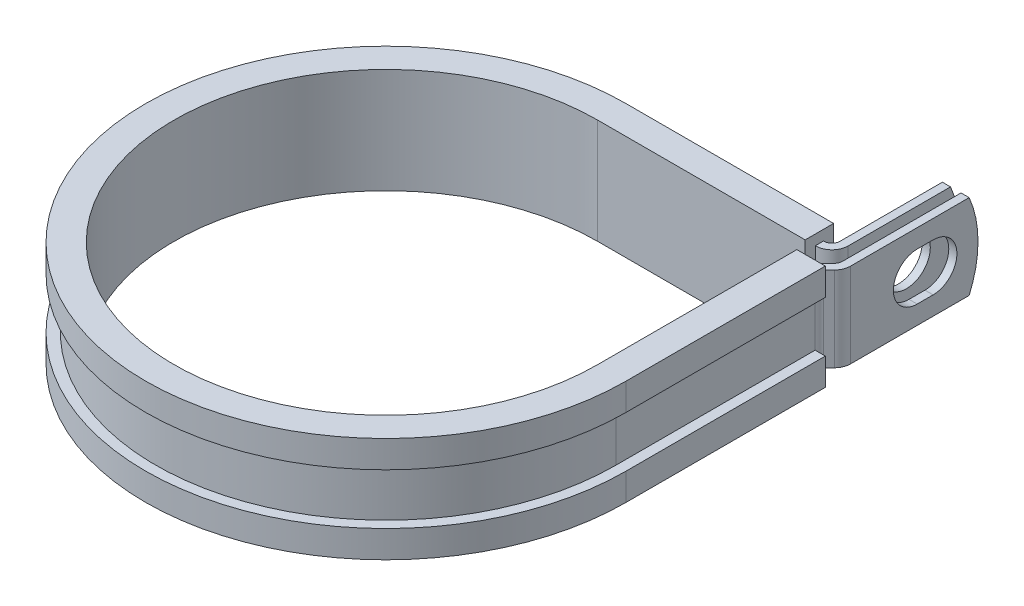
ISO-10303-21;
HEADER;
FILE_DESCRIPTION(('STEP AP214'),'2;1');
FILE_NAME('part.step','',(''),(''),'','','');
FILE_SCHEMA(('AUTOMOTIVE_DESIGN { 1 0 10303 214 1 1 1 1 }'));
ENDSEC;
DATA;
#1=APPLICATION_CONTEXT('core data for automotive mechanical design processes');
#2=APPLICATION_PROTOCOL_DEFINITION('international standard','automotive_design',2000,#1);
#3=PRODUCT_CONTEXT('',#1,'mechanical');
#4=PRODUCT('Part','Part','',(#3));
#5=PRODUCT_RELATED_PRODUCT_CATEGORY('part','',(#4));
#6=PRODUCT_DEFINITION_FORMATION('','',#4);
#7=PRODUCT_DEFINITION_CONTEXT('part definition',#1,'design');
#8=PRODUCT_DEFINITION('design','',#6,#7);
#9=PRODUCT_DEFINITION_SHAPE('','',#8);
#10=(LENGTH_UNIT() NAMED_UNIT(*) SI_UNIT(.MILLI.,.METRE.));
#11=(NAMED_UNIT(*) PLANE_ANGLE_UNIT() SI_UNIT($,.RADIAN.));
#12=(NAMED_UNIT(*) SI_UNIT($,.STERADIAN.) SOLID_ANGLE_UNIT());
#13=UNCERTAINTY_MEASURE_WITH_UNIT(LENGTH_MEASURE(1.E-05),#10,'distance_accuracy_value','');
#14=(GEOMETRIC_REPRESENTATION_CONTEXT(3) GLOBAL_UNCERTAINTY_ASSIGNED_CONTEXT((#13)) GLOBAL_UNIT_ASSIGNED_CONTEXT((#10,
#11,#12)) REPRESENTATION_CONTEXT('',''));
#15=CARTESIAN_POINT('',(0.,0.,0.));
#16=DIRECTION('',(0.,0.,1.));
#17=DIRECTION('',(1.,0.,0.));
#18=AXIS2_PLACEMENT_3D('',#15,#16,#17);
#19=CARTESIAN_POINT('',(33.9522698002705,-6.35,-33.274));
#20=DIRECTION('',(0.,1.,0.));
#21=DIRECTION('',(1.,0.,0.));
#22=AXIS2_PLACEMENT_3D('',#19,#20,#21);
#23=PLANE('',#22);
#24=DIRECTION('',(0.,0.,-1.));
#25=VECTOR('',#24,1.);
#26=CARTESIAN_POINT('',(31.1074698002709,-6.35,-33.274));
#27=LINE('',#26,#25);
#28=CARTESIAN_POINT('',(31.1074698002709,-6.35,-33.274));
#29=VERTEX_POINT('',#28);
#30=CARTESIAN_POINT('',(31.1074698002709,-6.35,-34.4932));
#31=VERTEX_POINT('',#30);
#32=EDGE_CURVE('E524',#29,#31,#27,.T.);
#33=ORIENTED_EDGE('',*,*,#32,.T.);
#34=DIRECTION('',(1.,0.,0.));
#35=VECTOR('',#34,1.);
#36=CARTESIAN_POINT('',(0.,-6.35,-34.4932));
#37=LINE('',#36,#35);
#38=CARTESIAN_POINT('',(31.1582698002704,-6.35,-34.4932));
#39=VERTEX_POINT('',#38);
#40=EDGE_CURVE('E411',#39,#31,#37,.F.);
#41=ORIENTED_EDGE('',*,*,#40,.F.);
#42=CARTESIAN_POINT('',(31.1582698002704,-6.35,-35.7124));
#43=DIRECTION('',(0.,1.,0.));
#44=DIRECTION('',(1.,0.,0.));
#45=AXIS2_PLACEMENT_3D('',#42,#43,#44);
#46=CIRCLE('',#45,1.2192);
#47=CARTESIAN_POINT('',(32.3774698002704,-6.35,-35.7124));
#48=VERTEX_POINT('',#47);
#49=EDGE_CURVE('E409',#48,#39,#46,.F.);
#50=ORIENTED_EDGE('',*,*,#49,.F.);
#51=DIRECTION('',(0.,0.,-1.));
#52=VECTOR('',#51,1.);
#53=CARTESIAN_POINT('',(32.3774698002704,-6.35,-52.3748));
#54=LINE('',#53,#52);
#55=CARTESIAN_POINT('',(32.3774698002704,-6.35,-51.0494778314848));
#56=VERTEX_POINT('',#55);
#57=EDGE_CURVE('E407',#56,#48,#54,.F.);
#58=ORIENTED_EDGE('',*,*,#57,.F.);
#59=DIRECTION('',(-1.,0.,0.));
#60=VECTOR('',#59,1.);
#61=CARTESIAN_POINT('',(36.3906698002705,-6.35,-51.0494778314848));
#62=LINE('',#61,#60);
#63=CARTESIAN_POINT('',(33.5966698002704,-6.35,-51.0494778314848));
#64=VERTEX_POINT('',#63);
#65=EDGE_CURVE('E12',#64,#56,#62,.T.);
#66=ORIENTED_EDGE('',*,*,#65,.F.);
#67=DIRECTION('',(0.,0.,1.));
#68=VECTOR('',#67,1.);
#69=CARTESIAN_POINT('',(33.5966698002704,-6.35,-52.3748));
#70=LINE('',#69,#68);
#71=CARTESIAN_POINT('',(33.5966698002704,-6.35,-35.7124));
#72=VERTEX_POINT('',#71);
#73=EDGE_CURVE('E405',#64,#72,#70,.T.);
#74=ORIENTED_EDGE('',*,*,#73,.T.);
#75=CARTESIAN_POINT('',(31.1582698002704,-6.35,-35.7124));
#76=DIRECTION('',(0.,-1.,0.));
#77=DIRECTION('',(0.,0.,1.));
#78=AXIS2_PLACEMENT_3D('',#75,#76,#77);
#79=CIRCLE('',#78,2.4384);
#80=CARTESIAN_POINT('',(31.1582698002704,-6.35,-33.274));
#81=VERTEX_POINT('',#80);
#82=EDGE_CURVE('E402',#72,#81,#79,.T.);
#83=ORIENTED_EDGE('',*,*,#82,.T.);
#84=DIRECTION('',(-1.,0.,0.));
#85=VECTOR('',#84,1.);
#86=CARTESIAN_POINT('',(0.,-6.35,-33.274));
#87=LINE('',#86,#85);
#88=EDGE_CURVE('E399',#81,#29,#87,.T.);
#89=ORIENTED_EDGE('',*,*,#88,.T.);
#90=EDGE_LOOP('',(#33,#41,#50,#58,#66,#74,#83,#89));
#91=FACE_BOUND('',#90,.T.);
#92=ADVANCED_FACE('F55',(#91),#23,.F.);
#93=CARTESIAN_POINT('',(33.9522698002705,6.35,-33.274));
#94=DIRECTION('',(0.,1.,0.));
#95=DIRECTION('',(1.,0.,0.));
#96=AXIS2_PLACEMENT_3D('',#93,#94,#95);
#97=PLANE('',#96);
#98=DIRECTION('',(1.,0.,0.));
#99=VECTOR('',#98,1.);
#100=CARTESIAN_POINT('',(0.,6.35,-34.4932));
#101=LINE('',#100,#99);
#102=CARTESIAN_POINT('',(31.1582698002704,6.35,-34.4932));
#103=VERTEX_POINT('',#102);
#104=CARTESIAN_POINT('',(31.1074698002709,6.35,-34.4932));
#105=VERTEX_POINT('',#104);
#106=EDGE_CURVE('E369',#103,#105,#101,.F.);
#107=ORIENTED_EDGE('',*,*,#106,.T.);
#108=DIRECTION('',(0.,0.,1.));
#109=VECTOR('',#108,1.);
#110=CARTESIAN_POINT('',(31.1074698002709,6.35,-34.4932));
#111=LINE('',#110,#109);
#112=CARTESIAN_POINT('',(31.1074698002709,6.35,-33.274));
#113=VERTEX_POINT('',#112);
#114=EDGE_CURVE('E518',#105,#113,#111,.T.);
#115=ORIENTED_EDGE('',*,*,#114,.T.);
#116=DIRECTION('',(-1.,0.,0.));
#117=VECTOR('',#116,1.);
#118=CARTESIAN_POINT('',(0.,6.35,-33.274));
#119=LINE('',#118,#117);
#120=CARTESIAN_POINT('',(31.1582698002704,6.35,-33.274));
#121=VERTEX_POINT('',#120);
#122=EDGE_CURVE('E626',#121,#113,#119,.T.);
#123=ORIENTED_EDGE('',*,*,#122,.F.);
#124=CARTESIAN_POINT('',(31.1582698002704,6.35,-35.7124));
#125=DIRECTION('',(0.,-1.,0.));
#126=DIRECTION('',(0.,0.,1.));
#127=AXIS2_PLACEMENT_3D('',#124,#125,#126);
#128=CIRCLE('',#127,2.4384);
#129=CARTESIAN_POINT('',(33.5966698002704,6.35,-35.7124));
#130=VERTEX_POINT('',#129);
#131=EDGE_CURVE('E371',#130,#121,#128,.T.);
#132=ORIENTED_EDGE('',*,*,#131,.F.);
#133=DIRECTION('',(0.,0.,1.));
#134=VECTOR('',#133,1.);
#135=CARTESIAN_POINT('',(33.5966698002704,6.35,-52.3748));
#136=LINE('',#135,#134);
#137=CARTESIAN_POINT('',(33.5966698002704,6.35,-51.0494778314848));
#138=VERTEX_POINT('',#137);
#139=EDGE_CURVE('E362',#138,#130,#136,.T.);
#140=ORIENTED_EDGE('',*,*,#139,.F.);
#141=DIRECTION('',(-1.,0.,0.));
#142=VECTOR('',#141,1.);
#143=CARTESIAN_POINT('',(36.3906698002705,6.35,-51.0494778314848));
#144=LINE('',#143,#142);
#145=CARTESIAN_POINT('',(32.3774698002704,6.35,-51.0494778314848));
#146=VERTEX_POINT('',#145);
#147=EDGE_CURVE('E63',#138,#146,#144,.T.);
#148=ORIENTED_EDGE('',*,*,#147,.T.);
#149=DIRECTION('',(0.,0.,-1.));
#150=VECTOR('',#149,1.);
#151=CARTESIAN_POINT('',(32.3774698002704,6.35,-52.3748));
#152=LINE('',#151,#150);
#153=CARTESIAN_POINT('',(32.3774698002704,6.35,-35.7124));
#154=VERTEX_POINT('',#153);
#155=EDGE_CURVE('E359',#146,#154,#152,.F.);
#156=ORIENTED_EDGE('',*,*,#155,.T.);
#157=CARTESIAN_POINT('',(31.1582698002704,6.35,-35.7124));
#158=DIRECTION('',(0.,1.,0.));
#159=DIRECTION('',(1.,0.,0.));
#160=AXIS2_PLACEMENT_3D('',#157,#158,#159);
#161=CIRCLE('',#160,1.2192);
#162=EDGE_CURVE('E367',#154,#103,#161,.F.);
#163=ORIENTED_EDGE('',*,*,#162,.T.);
#164=EDGE_LOOP('',(#107,#115,#123,#132,#140,#148,#156,#163));
#165=FACE_BOUND('',#164,.T.);
#166=ADVANCED_FACE('F358',(#165),#97,.T.);
#167=CARTESIAN_POINT('',(0.,6.35,-33.274));
#168=DIRECTION('',(0.,0.,1.));
#169=DIRECTION('',(1.,0.,0.));
#170=AXIS2_PLACEMENT_3D('',#167,#168,#169);
#171=PLANE('',#170);
#172=ORIENTED_EDGE('',*,*,#122,.T.);
#173=DIRECTION('',(0.,-1.,0.));
#174=VECTOR('',#173,1.);
#175=CARTESIAN_POINT('',(31.1074698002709,6.35,-33.274));
#176=LINE('',#175,#174);
#177=EDGE_CURVE('E521',#113,#29,#176,.T.);
#178=ORIENTED_EDGE('',*,*,#177,.T.);
#179=ORIENTED_EDGE('',*,*,#88,.F.);
#180=DIRECTION('',(0.,-1.,0.));
#181=VECTOR('',#180,1.);
#182=CARTESIAN_POINT('',(31.1582698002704,6.35,-33.274));
#183=LINE('',#182,#181);
#184=EDGE_CURVE('E345',#121,#81,#183,.T.);
#185=ORIENTED_EDGE('',*,*,#184,.F.);
#186=EDGE_LOOP('',(#172,#178,#179,#185));
#187=FACE_BOUND('',#186,.T.);
#188=ADVANCED_FACE('F636',(#187),#171,.T.);
#189=CARTESIAN_POINT('',(36.3906698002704,6.35,-33.274));
#190=DIRECTION('',(-1.,0.,0.));
#191=DIRECTION('',(0.,0.,1.));
#192=AXIS2_PLACEMENT_3D('',#189,#190,#191);
#193=PLANE('',#192);
#194=CARTESIAN_POINT('',(36.3906698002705,0.,-45.6437999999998));
#195=DIRECTION('',(1.,0.,0.));
#196=DIRECTION('',(0.,0.,-1.));
#197=AXIS2_PLACEMENT_3D('',#194,#195,#196);
#198=CIRCLE('',#197,3.5687);
#199=CARTESIAN_POINT('',(36.3906698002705,-3.5687,-45.6438000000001));
#200=VERTEX_POINT('',#199);
#201=CARTESIAN_POINT('',(36.3906698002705,3.5687,-45.6438000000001));
#202=VERTEX_POINT('',#201);
#203=EDGE_CURVE('E581',#200,#202,#198,.T.);
#204=ORIENTED_EDGE('',*,*,#203,.F.);
#205=DIRECTION('',(0.,0.,-1.));
#206=VECTOR('',#205,1.);
#207=CARTESIAN_POINT('',(36.3906698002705,-3.5687,-43.2561999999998));
#208=LINE('',#207,#206);
#209=CARTESIAN_POINT('',(36.3906698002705,-3.5687,-43.2561999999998));
#210=VERTEX_POINT('',#209);
#211=EDGE_CURVE('E584',#210,#200,#208,.T.);
#212=ORIENTED_EDGE('',*,*,#211,.F.);
#213=CARTESIAN_POINT('',(36.3906698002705,0.,-43.2561999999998));
#214=DIRECTION('',(1.,0.,0.));
#215=DIRECTION('',(0.,0.,-1.));
#216=AXIS2_PLACEMENT_3D('',#213,#214,#215);
#217=CIRCLE('',#216,3.5687);
#218=CARTESIAN_POINT('',(36.3906698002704,3.5687,-43.2561999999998));
#219=VERTEX_POINT('',#218);
#220=EDGE_CURVE('E577',#219,#210,#217,.T.);
#221=ORIENTED_EDGE('',*,*,#220,.F.);
#222=DIRECTION('',(0.,0.,1.));
#223=VECTOR('',#222,1.);
#224=CARTESIAN_POINT('',(36.3906698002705,3.5687,-43.2561999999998));
#225=LINE('',#224,#223);
#226=EDGE_CURVE('E578',#202,#219,#225,.T.);
#227=ORIENTED_EDGE('',*,*,#226,.F.);
#228=EDGE_LOOP('',(#204,#212,#221,#227));
#229=FACE_BOUND('',#228,.T.);
#230=DIRECTION('',(0.,0.,-1.));
#231=VECTOR('',#230,1.);
#232=CARTESIAN_POINT('',(36.3906698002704,-6.35,-33.274));
#233=LINE('',#232,#231);
#234=CARTESIAN_POINT('',(36.3906698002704,-6.35,-33.274));
#235=VERTEX_POINT('',#234);
#236=CARTESIAN_POINT('',(36.3906698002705,-6.35,-51.0494778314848));
#237=VERTEX_POINT('',#236);
#238=EDGE_CURVE('E383',#235,#237,#233,.T.);
#239=ORIENTED_EDGE('',*,*,#238,.T.);
#240=CARTESIAN_POINT('',(36.3906698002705,0.,-36.4998));
#241=DIRECTION('',(-1.,0.,0.));
#242=DIRECTION('',(0.,0.,1.));
#243=AXIS2_PLACEMENT_3D('',#240,#241,#242);
#244=CIRCLE('',#243,15.875);
#245=CARTESIAN_POINT('',(36.3906698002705,6.35,-51.0494778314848));
#246=VERTEX_POINT('',#245);
#247=EDGE_CURVE('E569',#246,#237,#244,.T.);
#248=ORIENTED_EDGE('',*,*,#247,.F.);
#249=DIRECTION('',(0.,0.,-1.));
#250=VECTOR('',#249,1.);
#251=CARTESIAN_POINT('',(36.3906698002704,6.35,-33.274));
#252=LINE('',#251,#250);
#253=CARTESIAN_POINT('',(36.3906698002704,6.35,-33.274));
#254=VERTEX_POINT('',#253);
#255=EDGE_CURVE('E420',#254,#246,#252,.T.);
#256=ORIENTED_EDGE('',*,*,#255,.F.);
#257=DIRECTION('',(0.,-1.,0.));
#258=VECTOR('',#257,1.);
#259=CARTESIAN_POINT('',(36.3906698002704,6.35,-33.274));
#260=LINE('',#259,#258);
#261=EDGE_CURVE('E382',#254,#235,#260,.T.);
#262=ORIENTED_EDGE('',*,*,#261,.T.);
#263=EDGE_LOOP('',(#239,#248,#256,#262));
#264=FACE_BOUND('',#263,.T.);
#265=ADVANCED_FACE('F57',(#229,#264),#193,.F.);
#266=CARTESIAN_POINT('',(35.1714698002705,6.35,-33.274));
#267=DIRECTION('',(-1.,0.,0.));
#268=DIRECTION('',(0.,0.,1.));
#269=AXIS2_PLACEMENT_3D('',#266,#267,#268);
#270=PLANE('',#269);
#271=DIRECTION('',(0.,0.,-1.));
#272=VECTOR('',#271,1.);
#273=CARTESIAN_POINT('',(35.1714698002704,-3.5687,-43.2561999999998));
#274=LINE('',#273,#272);
#275=CARTESIAN_POINT('',(35.1714698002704,-3.5687,-43.2561999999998));
#276=VERTEX_POINT('',#275);
#277=CARTESIAN_POINT('',(35.1714698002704,-3.5687,-45.6438000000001));
#278=VERTEX_POINT('',#277);
#279=EDGE_CURVE('E580',#276,#278,#274,.T.);
#280=ORIENTED_EDGE('',*,*,#279,.T.);
#281=CARTESIAN_POINT('',(35.1714698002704,0.,-45.6437999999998));
#282=DIRECTION('',(-1.,0.,0.));
#283=DIRECTION('',(0.,0.,1.));
#284=AXIS2_PLACEMENT_3D('',#281,#282,#283);
#285=CIRCLE('',#284,3.5687);
#286=CARTESIAN_POINT('',(35.1714698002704,3.5687,-45.6438000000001));
#287=VERTEX_POINT('',#286);
#288=EDGE_CURVE('E601',#278,#287,#285,.F.);
#289=ORIENTED_EDGE('',*,*,#288,.T.);
#290=DIRECTION('',(0.,0.,1.));
#291=VECTOR('',#290,1.);
#292=CARTESIAN_POINT('',(35.1714698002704,3.5687,-43.2561999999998));
#293=LINE('',#292,#291);
#294=CARTESIAN_POINT('',(35.1714698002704,3.5687,-43.2561999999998));
#295=VERTEX_POINT('',#294);
#296=EDGE_CURVE('E597',#287,#295,#293,.T.);
#297=ORIENTED_EDGE('',*,*,#296,.T.);
#298=CARTESIAN_POINT('',(35.1714698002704,0.,-43.2561999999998));
#299=DIRECTION('',(-1.,0.,0.));
#300=DIRECTION('',(0.,0.,1.));
#301=AXIS2_PLACEMENT_3D('',#298,#299,#300);
#302=CIRCLE('',#301,3.5687);
#303=EDGE_CURVE('E592',#295,#276,#302,.F.);
#304=ORIENTED_EDGE('',*,*,#303,.T.);
#305=EDGE_LOOP('',(#280,#289,#297,#304));
#306=FACE_BOUND('',#305,.T.);
#307=CARTESIAN_POINT('',(35.1714698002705,0.,-36.4998));
#308=DIRECTION('',(-1.,0.,0.));
#309=DIRECTION('',(0.,0.,1.));
#310=AXIS2_PLACEMENT_3D('',#307,#308,#309);
#311=CIRCLE('',#310,15.875);
#312=CARTESIAN_POINT('',(35.1714698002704,6.35,-51.0494778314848));
#313=VERTEX_POINT('',#312);
#314=CARTESIAN_POINT('',(35.1714698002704,-6.35,-51.0494778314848));
#315=VERTEX_POINT('',#314);
#316=EDGE_CURVE('E77',#313,#315,#311,.T.);
#317=ORIENTED_EDGE('',*,*,#316,.T.);
#318=DIRECTION('',(0.,0.,-1.));
#319=VECTOR('',#318,1.);
#320=CARTESIAN_POINT('',(35.1714698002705,-6.35,-33.274));
#321=LINE('',#320,#319);
#322=CARTESIAN_POINT('',(35.1714698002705,-6.35,-33.274));
#323=VERTEX_POINT('',#322);
#324=EDGE_CURVE('E386',#323,#315,#321,.T.);
#325=ORIENTED_EDGE('',*,*,#324,.F.);
#326=DIRECTION('',(0.,-1.,0.));
#327=VECTOR('',#326,1.);
#328=CARTESIAN_POINT('',(35.1714698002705,6.35,-33.274));
#329=LINE('',#328,#327);
#330=CARTESIAN_POINT('',(35.1714698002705,6.35,-33.274));
#331=VERTEX_POINT('',#330);
#332=EDGE_CURVE('E353',#331,#323,#329,.T.);
#333=ORIENTED_EDGE('',*,*,#332,.F.);
#334=DIRECTION('',(0.,0.,-1.));
#335=VECTOR('',#334,1.);
#336=CARTESIAN_POINT('',(35.1714698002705,6.35,-33.274));
#337=LINE('',#336,#335);
#338=EDGE_CURVE('E616',#331,#313,#337,.T.);
#339=ORIENTED_EDGE('',*,*,#338,.T.);
#340=EDGE_LOOP('',(#317,#325,#333,#339));
#341=FACE_BOUND('',#340,.T.);
#342=ADVANCED_FACE('F690',(#306,#341),#270,.T.);
#343=CARTESIAN_POINT('',(33.5966698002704,6.35,-52.3748));
#344=DIRECTION('',(1.,0.,0.));
#345=DIRECTION('',(0.,0.,-1.));
#346=AXIS2_PLACEMENT_3D('',#343,#344,#345);
#347=PLANE('',#346);
#348=CARTESIAN_POINT('',(33.5966698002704,0.,-44.45));
#349=DIRECTION('',(1.,0.,0.));
#350=DIRECTION('',(0.,0.,-1.));
#351=AXIS2_PLACEMENT_3D('',#348,#349,#350);
#352=CIRCLE('',#351,3.5687);
#353=CARTESIAN_POINT('',(33.5966698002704,0.,-48.0187));
#354=VERTEX_POINT('',#353);
#355=EDGE_CURVE('E387',#354,#354,#352,.F.);
#356=ORIENTED_EDGE('',*,*,#355,.T.);
#357=EDGE_LOOP('',(#356));
#358=FACE_BOUND('',#357,.T.);
#359=ORIENTED_EDGE('',*,*,#73,.F.);
#360=CARTESIAN_POINT('',(33.5966698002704,0.,-36.4998));
#361=DIRECTION('',(1.,0.,0.));
#362=DIRECTION('',(0.,0.,-1.));
#363=AXIS2_PLACEMENT_3D('',#360,#361,#362);
#364=CIRCLE('',#363,15.875);
#365=EDGE_CURVE('E574',#64,#138,#364,.T.);
#366=ORIENTED_EDGE('',*,*,#365,.T.);
#367=ORIENTED_EDGE('',*,*,#139,.T.);
#368=DIRECTION('',(0.,-1.,0.));
#369=VECTOR('',#368,1.);
#370=CARTESIAN_POINT('',(33.5966698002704,6.35,-35.7124));
#371=LINE('',#370,#369);
#372=EDGE_CURVE('E342',#130,#72,#371,.T.);
#373=ORIENTED_EDGE('',*,*,#372,.T.);
#374=EDGE_LOOP('',(#359,#366,#367,#373));
#375=FACE_BOUND('',#374,.T.);
#376=ADVANCED_FACE('F642',(#358,#375),#347,.T.);
#377=CARTESIAN_POINT('',(32.3774698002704,6.35,-52.3748));
#378=DIRECTION('',(1.,0.,0.));
#379=DIRECTION('',(0.,0.,-1.));
#380=AXIS2_PLACEMENT_3D('',#377,#378,#379);
#381=PLANE('',#380);
#382=CARTESIAN_POINT('',(32.3774698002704,0.,-44.45));
#383=DIRECTION('',(-1.,0.,0.));
#384=DIRECTION('',(0.,0.,1.));
#385=AXIS2_PLACEMENT_3D('',#382,#383,#384);
#386=CIRCLE('',#385,3.5687);
#387=CARTESIAN_POINT('',(32.3774698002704,0.,-40.8813));
#388=VERTEX_POINT('',#387);
#389=EDGE_CURVE('E609',#388,#388,#386,.T.);
#390=ORIENTED_EDGE('',*,*,#389,.F.);
#391=EDGE_LOOP('',(#390));
#392=FACE_BOUND('',#391,.T.);
#393=CARTESIAN_POINT('',(32.3774698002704,0.,-36.4998));
#394=DIRECTION('',(-1.,0.,0.));
#395=DIRECTION('',(0.,0.,1.));
#396=AXIS2_PLACEMENT_3D('',#393,#394,#395);
#397=CIRCLE('',#396,15.875);
#398=EDGE_CURVE('E69',#146,#56,#397,.T.);
#399=ORIENTED_EDGE('',*,*,#398,.T.);
#400=ORIENTED_EDGE('',*,*,#57,.T.);
#401=DIRECTION('',(0.,-1.,0.));
#402=VECTOR('',#401,1.);
#403=CARTESIAN_POINT('',(32.3774698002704,6.35,-35.7124));
#404=LINE('',#403,#402);
#405=EDGE_CURVE('E339',#154,#48,#404,.T.);
#406=ORIENTED_EDGE('',*,*,#405,.F.);
#407=ORIENTED_EDGE('',*,*,#155,.F.);
#408=EDGE_LOOP('',(#399,#400,#406,#407));
#409=FACE_BOUND('',#408,.T.);
#410=ADVANCED_FACE('F365',(#392,#409),#381,.F.);
#411=CARTESIAN_POINT('',(35.7124,-6.35,-29.8615026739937));
#412=DIRECTION('',(0.,1.,0.));
#413=DIRECTION('',(1.,0.,0.));
#414=AXIS2_PLACEMENT_3D('',#411,#412,#413);
#415=CIRCLE('',#414,1.21919999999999);
#416=CARTESIAN_POINT('',(34.4932,-6.35,-29.8615026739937));
#417=VERTEX_POINT('',#416);
#418=CARTESIAN_POINT('',(34.8502954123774,-6.35,-30.7236072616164));
#419=VERTEX_POINT('',#418);
#420=EDGE_CURVE('E414',#417,#419,#415,.F.);
#421=ORIENTED_EDGE('',*,*,#420,.F.);
#422=DIRECTION('',(1.,0.,0.));
#423=VECTOR('',#422,1.);
#424=CARTESIAN_POINT('',(33.274,-6.35,-29.8615026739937));
#425=LINE('',#424,#423);
#426=CARTESIAN_POINT('',(33.274,-6.35,-29.8615026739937));
#427=VERTEX_POINT('',#426);
#428=EDGE_CURVE('E452',#427,#417,#425,.T.);
#429=ORIENTED_EDGE('',*,*,#428,.F.);
#430=CARTESIAN_POINT('',(35.7124,-6.35,-29.8615026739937));
#431=DIRECTION('',(0.,-1.,0.));
#432=DIRECTION('',(0.,0.,1.));
#433=AXIS2_PLACEMENT_3D('',#430,#431,#432);
#434=CIRCLE('',#433,2.43839999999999);
#435=CARTESIAN_POINT('',(33.9881908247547,-6.35,-31.585711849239));
#436=VERTEX_POINT('',#435);
#437=EDGE_CURVE('E396',#427,#436,#434,.T.);
#438=ORIENTED_EDGE('',*,*,#437,.T.);
#439=DIRECTION('',(0.707106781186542,0.,-0.707106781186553));
#440=VECTOR('',#439,1.);
#441=CARTESIAN_POINT('',(33.9881908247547,-6.35,-31.585711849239));
#442=LINE('',#441,#440);
#443=CARTESIAN_POINT('',(34.8143743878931,-6.35,-32.4118954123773));
#444=VERTEX_POINT('',#443);
#445=EDGE_CURVE('E393',#436,#444,#442,.T.);
#446=ORIENTED_EDGE('',*,*,#445,.T.);
#447=CARTESIAN_POINT('',(33.9522698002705,-6.35,-33.274));
#448=DIRECTION('',(0.,1.,0.));
#449=DIRECTION('',(0.,0.,1.));
#450=AXIS2_PLACEMENT_3D('',#447,#448,#449);
#451=CIRCLE('',#450,1.2192);
#452=EDGE_CURVE('E390',#444,#323,#451,.T.);
#453=ORIENTED_EDGE('',*,*,#452,.T.);
#454=ORIENTED_EDGE('',*,*,#324,.T.);
#455=DIRECTION('',(-1.,0.,0.));
#456=VECTOR('',#455,1.);
#457=CARTESIAN_POINT('',(36.3906698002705,-6.35,-51.0494778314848));
#458=LINE('',#457,#456);
#459=EDGE_CURVE('E567',#237,#315,#458,.T.);
#460=ORIENTED_EDGE('',*,*,#459,.F.);
#461=ORIENTED_EDGE('',*,*,#238,.F.);
#462=CARTESIAN_POINT('',(33.9522698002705,-6.35,-33.274));
#463=DIRECTION('',(0.,1.,0.));
#464=DIRECTION('',(1.,0.,0.));
#465=AXIS2_PLACEMENT_3D('',#462,#463,#464);
#466=CIRCLE('',#465,2.4384);
#467=CARTESIAN_POINT('',(35.6764789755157,-6.35,-31.5497908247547));
#468=VERTEX_POINT('',#467);
#469=EDGE_CURVE('E418',#468,#235,#466,.T.);
#470=ORIENTED_EDGE('',*,*,#469,.F.);
#471=DIRECTION('',(0.707106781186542,0.,-0.707106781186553));
#472=VECTOR('',#471,1.);
#473=CARTESIAN_POINT('',(34.8502954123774,-6.35,-30.7236072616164));
#474=LINE('',#473,#472);
#475=EDGE_CURVE('E416',#419,#468,#474,.T.);
#476=ORIENTED_EDGE('',*,*,#475,.F.);
#477=EDGE_LOOP('',(#421,#429,#438,#446,#453,#454,#460,#461,#470,#476));
#478=FACE_BOUND('',#477,.T.);
#479=ADVANCED_FACE('F676',(#478),#23,.F.);
#480=DIRECTION('',(-1.,0.,0.));
#481=VECTOR('',#480,1.);
#482=CARTESIAN_POINT('',(34.4932,6.35,-29.8615026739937));
#483=LINE('',#482,#481);
#484=CARTESIAN_POINT('',(34.4932,6.35,-29.8615026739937));
#485=VERTEX_POINT('',#484);
#486=CARTESIAN_POINT('',(33.274,6.35,-29.8615026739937));
#487=VERTEX_POINT('',#486);
#488=EDGE_CURVE('E441',#485,#487,#483,.T.);
#489=ORIENTED_EDGE('',*,*,#488,.F.);
#490=CARTESIAN_POINT('',(35.7124,6.35,-29.8615026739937));
#491=DIRECTION('',(0.,1.,0.));
#492=DIRECTION('',(1.,0.,0.));
#493=AXIS2_PLACEMENT_3D('',#490,#491,#492);
#494=CIRCLE('',#493,1.21919999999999);
#495=CARTESIAN_POINT('',(34.8502954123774,6.35,-30.7236072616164));
#496=VERTEX_POINT('',#495);
#497=EDGE_CURVE('E376',#485,#496,#494,.F.);
#498=ORIENTED_EDGE('',*,*,#497,.T.);
#499=DIRECTION('',(0.707106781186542,0.,-0.707106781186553));
#500=VECTOR('',#499,1.);
#501=CARTESIAN_POINT('',(34.8502954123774,6.35,-30.7236072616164));
#502=LINE('',#501,#500);
#503=CARTESIAN_POINT('',(35.6764789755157,6.35,-31.5497908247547));
#504=VERTEX_POINT('',#503);
#505=EDGE_CURVE('E378',#496,#504,#502,.T.);
#506=ORIENTED_EDGE('',*,*,#505,.T.);
#507=CARTESIAN_POINT('',(33.9522698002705,6.35,-33.274));
#508=DIRECTION('',(0.,1.,0.));
#509=DIRECTION('',(1.,0.,0.));
#510=AXIS2_PLACEMENT_3D('',#507,#508,#509);
#511=CIRCLE('',#510,2.4384);
#512=EDGE_CURVE('E380',#504,#254,#511,.T.);
#513=ORIENTED_EDGE('',*,*,#512,.T.);
#514=ORIENTED_EDGE('',*,*,#255,.T.);
#515=DIRECTION('',(-1.,0.,0.));
#516=VECTOR('',#515,1.);
#517=CARTESIAN_POINT('',(36.3906698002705,6.35,-51.0494778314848));
#518=LINE('',#517,#516);
#519=EDGE_CURVE('E571',#246,#313,#518,.T.);
#520=ORIENTED_EDGE('',*,*,#519,.T.);
#521=ORIENTED_EDGE('',*,*,#338,.F.);
#522=CARTESIAN_POINT('',(33.9522698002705,6.35,-33.274));
#523=DIRECTION('',(0.,1.,0.));
#524=DIRECTION('',(0.,0.,1.));
#525=AXIS2_PLACEMENT_3D('',#522,#523,#524);
#526=CIRCLE('',#525,1.2192);
#527=CARTESIAN_POINT('',(34.8143743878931,6.35,-32.4118954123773));
#528=VERTEX_POINT('',#527);
#529=EDGE_CURVE('E619',#528,#331,#526,.T.);
#530=ORIENTED_EDGE('',*,*,#529,.F.);
#531=DIRECTION('',(0.707106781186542,0.,-0.707106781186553));
#532=VECTOR('',#531,1.);
#533=CARTESIAN_POINT('',(33.9881908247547,6.35,-31.585711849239));
#534=LINE('',#533,#532);
#535=CARTESIAN_POINT('',(33.9881908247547,6.35,-31.585711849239));
#536=VERTEX_POINT('',#535);
#537=EDGE_CURVE('E622',#536,#528,#534,.T.);
#538=ORIENTED_EDGE('',*,*,#537,.F.);
#539=CARTESIAN_POINT('',(35.7124,6.35,-29.8615026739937));
#540=DIRECTION('',(0.,-1.,0.));
#541=DIRECTION('',(0.,0.,1.));
#542=AXIS2_PLACEMENT_3D('',#539,#540,#541);
#543=CIRCLE('',#542,2.43839999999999);
#544=EDGE_CURVE('E451',#487,#536,#543,.T.);
#545=ORIENTED_EDGE('',*,*,#544,.F.);
#546=EDGE_LOOP('',(#489,#498,#506,#513,#514,#520,#521,#530,#538,#545));
#547=FACE_BOUND('',#546,.T.);
#548=ADVANCED_FACE('F448',(#547),#97,.T.);
#549=CARTESIAN_POINT('',(33.9522698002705,6.35,-33.274));
#550=DIRECTION('',(0.,-1.,0.));
#551=DIRECTION('',(0.,0.,-1.));
#552=AXIS2_PLACEMENT_3D('',#549,#550,#551);
#553=CYLINDRICAL_SURFACE('',#552,1.2192);
#554=ORIENTED_EDGE('',*,*,#452,.F.);
#555=DIRECTION('',(0.,-1.,0.));
#556=VECTOR('',#555,1.);
#557=CARTESIAN_POINT('',(34.8143743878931,6.35,-32.4118954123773));
#558=LINE('',#557,#556);
#559=EDGE_CURVE('E351',#528,#444,#558,.T.);
#560=ORIENTED_EDGE('',*,*,#559,.F.);
#561=ORIENTED_EDGE('',*,*,#529,.T.);
#562=ORIENTED_EDGE('',*,*,#332,.T.);
#563=EDGE_LOOP('',(#554,#560,#561,#562));
#564=FACE_BOUND('',#563,.T.);
#565=ADVANCED_FACE('F686',(#564),#553,.F.);
#566=CARTESIAN_POINT('',(33.9881908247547,6.35,-31.585711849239));
#567=DIRECTION('',(-0.707106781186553,0.,-0.707106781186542));
#568=DIRECTION('',(-0.707106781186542,0.,0.707106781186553));
#569=AXIS2_PLACEMENT_3D('',#566,#567,#568);
#570=PLANE('',#569);
#571=ORIENTED_EDGE('',*,*,#445,.F.);
#572=DIRECTION('',(0.,-1.,0.));
#573=VECTOR('',#572,1.);
#574=CARTESIAN_POINT('',(33.9881908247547,6.35,-31.585711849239));
#575=LINE('',#574,#573);
#576=EDGE_CURVE('E349',#536,#436,#575,.T.);
#577=ORIENTED_EDGE('',*,*,#576,.F.);
#578=ORIENTED_EDGE('',*,*,#537,.T.);
#579=ORIENTED_EDGE('',*,*,#559,.T.);
#580=EDGE_LOOP('',(#571,#577,#578,#579));
#581=FACE_BOUND('',#580,.T.);
#582=ADVANCED_FACE('F681',(#581),#570,.T.);
#583=CARTESIAN_POINT('',(35.7124,6.35,-29.8615026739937));
#584=DIRECTION('',(0.,-1.,0.));
#585=DIRECTION('',(0.,0.,-1.));
#586=AXIS2_PLACEMENT_3D('',#583,#584,#585);
#587=CYLINDRICAL_SURFACE('',#586,2.43839999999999);
#588=ORIENTED_EDGE('',*,*,#437,.F.);
#589=DIRECTION('',(0.,-1.,0.));
#590=VECTOR('',#589,1.);
#591=CARTESIAN_POINT('',(33.274,6.35,-29.8615026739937));
#592=LINE('',#591,#590);
#593=EDGE_CURVE('E347',#487,#427,#592,.T.);
#594=ORIENTED_EDGE('',*,*,#593,.F.);
#595=ORIENTED_EDGE('',*,*,#544,.T.);
#596=ORIENTED_EDGE('',*,*,#576,.T.);
#597=EDGE_LOOP('',(#588,#594,#595,#596));
#598=FACE_BOUND('',#597,.T.);
#599=ADVANCED_FACE('F678',(#598),#587,.T.);
#600=CARTESIAN_POINT('',(31.1582698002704,6.35,-35.7124));
#601=DIRECTION('',(0.,-1.,0.));
#602=DIRECTION('',(0.,0.,-1.));
#603=AXIS2_PLACEMENT_3D('',#600,#601,#602);
#604=CYLINDRICAL_SURFACE('',#603,2.4384);
#605=ORIENTED_EDGE('',*,*,#82,.F.);
#606=ORIENTED_EDGE('',*,*,#372,.F.);
#607=ORIENTED_EDGE('',*,*,#131,.T.);
#608=ORIENTED_EDGE('',*,*,#184,.T.);
#609=EDGE_LOOP('',(#605,#606,#607,#608));
#610=FACE_BOUND('',#609,.T.);
#611=ADVANCED_FACE('F632',(#610),#604,.T.);
#612=CARTESIAN_POINT('',(31.1582698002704,6.35,-35.7124));
#613=DIRECTION('',(0.,-1.,0.));
#614=DIRECTION('',(0.,0.,-1.));
#615=AXIS2_PLACEMENT_3D('',#612,#613,#614);
#616=CYLINDRICAL_SURFACE('',#615,1.2192);
#617=ORIENTED_EDGE('',*,*,#49,.T.);
#618=DIRECTION('',(0.,-1.,0.));
#619=VECTOR('',#618,1.);
#620=CARTESIAN_POINT('',(31.1582698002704,6.35,-34.4932));
#621=LINE('',#620,#619);
#622=EDGE_CURVE('E330',#103,#39,#621,.T.);
#623=ORIENTED_EDGE('',*,*,#622,.F.);
#624=ORIENTED_EDGE('',*,*,#162,.F.);
#625=ORIENTED_EDGE('',*,*,#405,.T.);
#626=EDGE_LOOP('',(#617,#623,#624,#625));
#627=FACE_BOUND('',#626,.T.);
#628=ADVANCED_FACE('F647',(#627),#616,.F.);
#629=CARTESIAN_POINT('',(0.,6.35,-34.4932));
#630=DIRECTION('',(0.,0.,1.));
#631=DIRECTION('',(1.,0.,0.));
#632=AXIS2_PLACEMENT_3D('',#629,#630,#631);
#633=PLANE('',#632);
#634=DIRECTION('',(0.,-1.,0.));
#635=VECTOR('',#634,1.);
#636=CARTESIAN_POINT('',(0.,6.35,-34.4932));
#637=LINE('',#636,#635);
#638=CARTESIAN_POINT('',(4.83841555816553E-13,3.81,-34.4932));
#639=VERTEX_POINT('',#638);
#640=CARTESIAN_POINT('',(4.83841555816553E-13,-3.81,-34.4932));
#641=VERTEX_POINT('',#640);
#642=EDGE_CURVE('E321',#639,#641,#637,.T.);
#643=ORIENTED_EDGE('',*,*,#642,.F.);
#644=DIRECTION('',(1.,0.,0.));
#645=VECTOR('',#644,1.);
#646=CARTESIAN_POINT('',(4.83841555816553E-13,3.81,-34.4932));
#647=LINE('',#646,#645);
#648=CARTESIAN_POINT('',(31.1074698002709,3.81,-34.4932));
#649=VERTEX_POINT('',#648);
#650=EDGE_CURVE('E564',#639,#649,#647,.T.);
#651=ORIENTED_EDGE('',*,*,#650,.T.);
#652=DIRECTION('',(0.,1.,0.));
#653=VECTOR('',#652,1.);
#654=CARTESIAN_POINT('',(31.1074698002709,6.35,-34.4932));
#655=LINE('',#654,#653);
#656=EDGE_CURVE('E515',#649,#105,#655,.T.);
#657=ORIENTED_EDGE('',*,*,#656,.T.);
#658=ORIENTED_EDGE('',*,*,#106,.F.);
#659=ORIENTED_EDGE('',*,*,#622,.T.);
#660=ORIENTED_EDGE('',*,*,#40,.T.);
#661=DIRECTION('',(0.,1.,0.));
#662=VECTOR('',#661,1.);
#663=CARTESIAN_POINT('',(31.1074698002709,-6.35,-34.4932));
#664=LINE('',#663,#662);
#665=CARTESIAN_POINT('',(31.1074698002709,-3.81,-34.4932));
#666=VERTEX_POINT('',#665);
#667=EDGE_CURVE('E527',#31,#666,#664,.T.);
#668=ORIENTED_EDGE('',*,*,#667,.T.);
#669=DIRECTION('',(1.,0.,0.));
#670=VECTOR('',#669,1.);
#671=CARTESIAN_POINT('',(4.83841555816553E-13,-3.81,-34.4932));
#672=LINE('',#671,#670);
#673=EDGE_CURVE('E544',#641,#666,#672,.T.);
#674=ORIENTED_EDGE('',*,*,#673,.F.);
#675=EDGE_LOOP('',(#643,#651,#657,#658,#659,#660,#668,#674));
#676=FACE_BOUND('',#675,.T.);
#677=ADVANCED_FACE('F651',(#676),#633,.F.);
#678=CARTESIAN_POINT('',(0.,6.35,0.));
#679=DIRECTION('',(0.,-1.,0.));
#680=DIRECTION('',(0.,0.,-1.));
#681=AXIS2_PLACEMENT_3D('',#678,#679,#680);
#682=CYLINDRICAL_SURFACE('',#681,34.4932);
#683=DIRECTION('',(0.,-1.,0.));
#684=VECTOR('',#683,1.);
#685=CARTESIAN_POINT('',(34.4932,6.35,0.));
#686=LINE('',#685,#684);
#687=CARTESIAN_POINT('',(34.4932,3.81,0.));
#688=VERTEX_POINT('',#687);
#689=CARTESIAN_POINT('',(34.4932,-3.81,0.));
#690=VERTEX_POINT('',#689);
#691=EDGE_CURVE('E319',#688,#690,#686,.T.);
#692=ORIENTED_EDGE('',*,*,#691,.F.);
#693=CARTESIAN_POINT('',(0.,3.81,0.));
#694=DIRECTION('',(0.,-1.,0.));
#695=DIRECTION('',(0.,0.,-1.));
#696=AXIS2_PLACEMENT_3D('',#693,#694,#695);
#697=CIRCLE('',#696,34.4932);
#698=EDGE_CURVE('E513',#688,#639,#697,.T.);
#699=ORIENTED_EDGE('',*,*,#698,.T.);
#700=ORIENTED_EDGE('',*,*,#642,.T.);
#701=CARTESIAN_POINT('',(0.,-3.81,0.));
#702=DIRECTION('',(0.,-1.,0.));
#703=DIRECTION('',(0.,0.,-1.));
#704=AXIS2_PLACEMENT_3D('',#701,#702,#703);
#705=CIRCLE('',#704,34.4932);
#706=EDGE_CURVE('E302',#690,#641,#705,.T.);
#707=ORIENTED_EDGE('',*,*,#706,.F.);
#708=EDGE_LOOP('',(#692,#699,#700,#707));
#709=FACE_BOUND('',#708,.T.);
#710=ADVANCED_FACE('F317',(#709),#682,.T.);
#711=CARTESIAN_POINT('',(34.4932,6.35,0.));
#712=DIRECTION('',(-1.,0.,0.));
#713=DIRECTION('',(0.,0.,1.));
#714=AXIS2_PLACEMENT_3D('',#711,#712,#713);
#715=PLANE('',#714);
#716=DIRECTION('',(0.,-1.,0.));
#717=VECTOR('',#716,1.);
#718=CARTESIAN_POINT('',(34.4932,6.35,-29.8615026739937));
#719=LINE('',#718,#717);
#720=CARTESIAN_POINT('',(34.4932,3.81,-29.8615026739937));
#721=VERTEX_POINT('',#720);
#722=CARTESIAN_POINT('',(34.4932,-3.81,-29.8615026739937));
#723=VERTEX_POINT('',#722);
#724=EDGE_CURVE('E333',#721,#723,#719,.T.);
#725=ORIENTED_EDGE('',*,*,#724,.F.);
#726=DIRECTION('',(0.,0.,-1.));
#727=VECTOR('',#726,1.);
#728=CARTESIAN_POINT('',(34.4932,3.81,0.));
#729=LINE('',#728,#727);
#730=EDGE_CURVE('E327',#688,#721,#729,.T.);
#731=ORIENTED_EDGE('',*,*,#730,.F.);
#732=ORIENTED_EDGE('',*,*,#691,.T.);
#733=DIRECTION('',(0.,0.,-1.));
#734=VECTOR('',#733,1.);
#735=CARTESIAN_POINT('',(34.4932,-3.81,0.));
#736=LINE('',#735,#734);
#737=EDGE_CURVE('E298',#690,#723,#736,.T.);
#738=ORIENTED_EDGE('',*,*,#737,.T.);
#739=EDGE_LOOP('',(#725,#731,#732,#738));
#740=FACE_BOUND('',#739,.T.);
#741=ADVANCED_FACE('F326',(#740),#715,.F.);
#742=CARTESIAN_POINT('',(35.7124,6.35,-29.8615026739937));
#743=DIRECTION('',(0.,-1.,0.));
#744=DIRECTION('',(0.,0.,-1.));
#745=AXIS2_PLACEMENT_3D('',#742,#743,#744);
#746=CYLINDRICAL_SURFACE('',#745,1.21919999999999);
#747=ORIENTED_EDGE('',*,*,#420,.T.);
#748=DIRECTION('',(0.,-1.,0.));
#749=VECTOR('',#748,1.);
#750=CARTESIAN_POINT('',(34.8502954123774,6.35,-30.7236072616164));
#751=LINE('',#750,#749);
#752=EDGE_CURVE('E425',#496,#419,#751,.T.);
#753=ORIENTED_EDGE('',*,*,#752,.F.);
#754=ORIENTED_EDGE('',*,*,#497,.F.);
#755=EDGE_CURVE('E328',#485,#721,#719,.T.);
#756=ORIENTED_EDGE('',*,*,#755,.T.);
#757=ORIENTED_EDGE('',*,*,#724,.T.);
#758=DIRECTION('',(0.,1.,0.));
#759=VECTOR('',#758,1.);
#760=CARTESIAN_POINT('',(34.4932,-6.35,-29.8615026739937));
#761=LINE('',#760,#759);
#762=EDGE_CURVE('E434',#417,#723,#761,.T.);
#763=ORIENTED_EDGE('',*,*,#762,.F.);
#764=EDGE_LOOP('',(#747,#753,#754,#756,#757,#763));
#765=FACE_BOUND('',#764,.T.);
#766=ADVANCED_FACE('F433',(#765),#746,.F.);
#767=CARTESIAN_POINT('',(34.8502954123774,6.35,-30.7236072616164));
#768=DIRECTION('',(-0.707106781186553,0.,-0.707106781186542));
#769=DIRECTION('',(-0.707106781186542,0.,0.707106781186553));
#770=AXIS2_PLACEMENT_3D('',#767,#768,#769);
#771=PLANE('',#770);
#772=ORIENTED_EDGE('',*,*,#475,.T.);
#773=DIRECTION('',(0.,-1.,0.));
#774=VECTOR('',#773,1.);
#775=CARTESIAN_POINT('',(35.6764789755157,6.35,-31.5497908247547));
#776=LINE('',#775,#774);
#777=EDGE_CURVE('E423',#504,#468,#776,.T.);
#778=ORIENTED_EDGE('',*,*,#777,.F.);
#779=ORIENTED_EDGE('',*,*,#505,.F.);
#780=ORIENTED_EDGE('',*,*,#752,.T.);
#781=EDGE_LOOP('',(#772,#778,#779,#780));
#782=FACE_BOUND('',#781,.T.);
#783=ADVANCED_FACE('F702',(#782),#771,.F.);
#784=CARTESIAN_POINT('',(33.9522698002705,6.35,-33.274));
#785=DIRECTION('',(0.,-1.,0.));
#786=DIRECTION('',(0.,0.,-1.));
#787=AXIS2_PLACEMENT_3D('',#784,#785,#786);
#788=CYLINDRICAL_SURFACE('',#787,2.4384);
#789=ORIENTED_EDGE('',*,*,#469,.T.);
#790=ORIENTED_EDGE('',*,*,#261,.F.);
#791=ORIENTED_EDGE('',*,*,#512,.F.);
#792=ORIENTED_EDGE('',*,*,#777,.T.);
#793=EDGE_LOOP('',(#789,#790,#791,#792));
#794=FACE_BOUND('',#793,.T.);
#795=ADVANCED_FACE('F700',(#794),#788,.T.);
#796=CARTESIAN_POINT('',(43.6904776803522,0.,-44.45));
#797=DIRECTION('',(-1.,0.,0.));
#798=DIRECTION('',(0.,0.,1.));
#799=AXIS2_PLACEMENT_3D('',#796,#797,#798);
#800=CYLINDRICAL_SURFACE('',#799,3.5687);
#801=ORIENTED_EDGE('',*,*,#389,.T.);
#802=EDGE_LOOP('',(#801));
#803=FACE_BOUND('',#802,.T.);
#804=ORIENTED_EDGE('',*,*,#355,.F.);
#805=EDGE_LOOP('',(#804));
#806=FACE_BOUND('',#805,.T.);
#807=ADVANCED_FACE('F709',(#803,#806),#800,.F.);
#808=CARTESIAN_POINT('',(23.2690287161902,-3.5687,-43.2561999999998));
#809=DIRECTION('',(0.,-1.,0.));
#810=DIRECTION('',(0.,0.,-1.));
#811=AXIS2_PLACEMENT_3D('',#808,#809,#810);
#812=PLANE('',#811);
#813=DIRECTION('',(1.,0.,0.));
#814=VECTOR('',#813,1.);
#815=CARTESIAN_POINT('',(23.2690287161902,-3.5687,-43.2561999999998));
#816=LINE('',#815,#814);
#817=EDGE_CURVE('E595',#276,#210,#816,.T.);
#818=ORIENTED_EDGE('',*,*,#817,.T.);
#819=ORIENTED_EDGE('',*,*,#211,.T.);
#820=DIRECTION('',(1.,0.,0.));
#821=VECTOR('',#820,1.);
#822=CARTESIAN_POINT('',(23.2690287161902,-3.5687,-45.6438000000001));
#823=LINE('',#822,#821);
#824=EDGE_CURVE('E591',#278,#200,#823,.T.);
#825=ORIENTED_EDGE('',*,*,#824,.F.);
#826=ORIENTED_EDGE('',*,*,#279,.F.);
#827=EDGE_LOOP('',(#818,#819,#825,#826));
#828=FACE_BOUND('',#827,.T.);
#829=ADVANCED_FACE('F752',(#828),#812,.F.);
#830=CARTESIAN_POINT('',(23.2690287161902,0.,-45.6437999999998));
#831=DIRECTION('',(1.,0.,0.));
#832=DIRECTION('',(0.,0.,-1.));
#833=AXIS2_PLACEMENT_3D('',#830,#831,#832);
#834=CYLINDRICAL_SURFACE('',#833,3.5687);
#835=ORIENTED_EDGE('',*,*,#824,.T.);
#836=ORIENTED_EDGE('',*,*,#203,.T.);
#837=DIRECTION('',(1.,0.,0.));
#838=VECTOR('',#837,1.);
#839=CARTESIAN_POINT('',(23.2690287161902,3.5687,-45.6438000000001));
#840=LINE('',#839,#838);
#841=EDGE_CURVE('E600',#287,#202,#840,.T.);
#842=ORIENTED_EDGE('',*,*,#841,.F.);
#843=ORIENTED_EDGE('',*,*,#288,.F.);
#844=EDGE_LOOP('',(#835,#836,#842,#843));
#845=FACE_BOUND('',#844,.T.);
#846=ADVANCED_FACE('F756',(#845),#834,.F.);
#847=CARTESIAN_POINT('',(23.2690287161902,3.5687,-43.2561999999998));
#848=DIRECTION('',(0.,1.,0.));
#849=DIRECTION('',(0.,0.,1.));
#850=AXIS2_PLACEMENT_3D('',#847,#848,#849);
#851=PLANE('',#850);
#852=ORIENTED_EDGE('',*,*,#841,.T.);
#853=ORIENTED_EDGE('',*,*,#226,.T.);
#854=DIRECTION('',(1.,0.,0.));
#855=VECTOR('',#854,1.);
#856=CARTESIAN_POINT('',(23.2690287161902,3.5687,-43.2561999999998));
#857=LINE('',#856,#855);
#858=EDGE_CURVE('E596',#295,#219,#857,.T.);
#859=ORIENTED_EDGE('',*,*,#858,.F.);
#860=ORIENTED_EDGE('',*,*,#296,.F.);
#861=EDGE_LOOP('',(#852,#853,#859,#860));
#862=FACE_BOUND('',#861,.T.);
#863=ADVANCED_FACE('F760',(#862),#851,.F.);
#864=CARTESIAN_POINT('',(23.2690287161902,0.,-43.2561999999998));
#865=DIRECTION('',(1.,0.,0.));
#866=DIRECTION('',(0.,0.,-1.));
#867=AXIS2_PLACEMENT_3D('',#864,#865,#866);
#868=CYLINDRICAL_SURFACE('',#867,3.5687);
#869=ORIENTED_EDGE('',*,*,#858,.T.);
#870=ORIENTED_EDGE('',*,*,#220,.T.);
#871=ORIENTED_EDGE('',*,*,#817,.F.);
#872=ORIENTED_EDGE('',*,*,#303,.F.);
#873=EDGE_LOOP('',(#869,#870,#871,#872));
#874=FACE_BOUND('',#873,.T.);
#875=ADVANCED_FACE('F764',(#874),#868,.F.);
#876=CARTESIAN_POINT('',(36.3906698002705,0.,-36.4998));
#877=DIRECTION('',(-1.,0.,0.));
#878=DIRECTION('',(0.,0.,1.));
#879=AXIS2_PLACEMENT_3D('',#876,#877,#878);
#880=CYLINDRICAL_SURFACE('',#879,15.875);
#881=ORIENTED_EDGE('',*,*,#365,.F.);
#882=ORIENTED_EDGE('',*,*,#65,.T.);
#883=ORIENTED_EDGE('',*,*,#398,.F.);
#884=ORIENTED_EDGE('',*,*,#147,.F.);
#885=EDGE_LOOP('',(#881,#882,#883,#884));
#886=FACE_BOUND('',#885,.T.);
#887=ADVANCED_FACE('F643',(#886),#880,.T.);
#888=ORIENTED_EDGE('',*,*,#519,.F.);
#889=ORIENTED_EDGE('',*,*,#247,.T.);
#890=ORIENTED_EDGE('',*,*,#459,.T.);
#891=ORIENTED_EDGE('',*,*,#316,.F.);
#892=EDGE_LOOP('',(#888,#889,#890,#891));
#893=FACE_BOUND('',#892,.T.);
#894=ADVANCED_FACE('F691',(#893),#880,.T.);
#895=CARTESIAN_POINT('',(5.05218944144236E-13,7.874,-36.0172));
#896=DIRECTION('',(0.,0.,1.));
#897=DIRECTION('',(1.,0.,0.));
#898=AXIS2_PLACEMENT_3D('',#895,#896,#897);
#899=PLANE('',#898);
#900=DIRECTION('',(0.,-1.,0.));
#901=VECTOR('',#900,1.);
#902=CARTESIAN_POINT('',(5.05218944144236E-13,7.874,-36.0172));
#903=LINE('',#902,#901);
#904=CARTESIAN_POINT('',(5.05218944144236E-13,7.874,-36.0172));
#905=VERTEX_POINT('',#904);
#906=CARTESIAN_POINT('',(5.05218944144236E-13,3.81,-36.0172));
#907=VERTEX_POINT('',#906);
#908=EDGE_CURVE('E323',#905,#907,#903,.T.);
#909=ORIENTED_EDGE('',*,*,#908,.F.);
#910=DIRECTION('',(1.,0.,0.));
#911=VECTOR('',#910,1.);
#912=CARTESIAN_POINT('',(5.05218944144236E-13,7.874,-36.0172));
#913=LINE('',#912,#911);
#914=CARTESIAN_POINT('',(31.1074698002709,7.874,-36.0172));
#915=VERTEX_POINT('',#914);
#916=EDGE_CURVE('E558',#905,#915,#913,.T.);
#917=ORIENTED_EDGE('',*,*,#916,.T.);
#918=DIRECTION('',(0.,-1.,0.));
#919=VECTOR('',#918,1.);
#920=CARTESIAN_POINT('',(31.1074698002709,7.874,-36.0172));
#921=LINE('',#920,#919);
#922=CARTESIAN_POINT('',(31.1074698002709,3.81,-36.0172));
#923=VERTEX_POINT('',#922);
#924=EDGE_CURVE('E540',#915,#923,#921,.T.);
#925=ORIENTED_EDGE('',*,*,#924,.T.);
#926=DIRECTION('',(1.,0.,0.));
#927=VECTOR('',#926,1.);
#928=CARTESIAN_POINT('',(5.05218944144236E-13,3.81,-36.0172));
#929=LINE('',#928,#927);
#930=EDGE_CURVE('E561',#907,#923,#929,.T.);
#931=ORIENTED_EDGE('',*,*,#930,.F.);
#932=EDGE_LOOP('',(#909,#917,#925,#931));
#933=FACE_BOUND('',#932,.T.);
#934=ADVANCED_FACE('F855',(#933),#899,.F.);
#935=CARTESIAN_POINT('',(4.45362256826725E-13,7.874,-31.75));
#936=DIRECTION('',(0.,0.,-1.));
#937=DIRECTION('',(-1.,0.,0.));
#938=AXIS2_PLACEMENT_3D('',#935,#936,#937);
#939=PLANE('',#938);
#940=DIRECTION('',(0.,1.,0.));
#941=VECTOR('',#940,1.);
#942=CARTESIAN_POINT('',(4.45362256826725E-13,7.874,-31.75));
#943=LINE('',#942,#941);
#944=CARTESIAN_POINT('',(4.45362256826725E-13,-7.874,-31.75));
#945=VERTEX_POINT('',#944);
#946=CARTESIAN_POINT('',(4.45362256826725E-13,7.874,-31.75));
#947=VERTEX_POINT('',#946);
#948=EDGE_CURVE('E491',#945,#947,#943,.T.);
#949=ORIENTED_EDGE('',*,*,#948,.F.);
#950=DIRECTION('',(1.,0.,0.));
#951=VECTOR('',#950,1.);
#952=CARTESIAN_POINT('',(4.45362256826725E-13,-7.874,-31.75));
#953=LINE('',#952,#951);
#954=CARTESIAN_POINT('',(31.1074698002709,-7.874,-31.75));
#955=VERTEX_POINT('',#954);
#956=EDGE_CURVE('E552',#945,#955,#953,.T.);
#957=ORIENTED_EDGE('',*,*,#956,.T.);
#958=DIRECTION('',(0.,1.,0.));
#959=VECTOR('',#958,1.);
#960=CARTESIAN_POINT('',(31.1074698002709,7.874,-31.75));
#961=LINE('',#960,#959);
#962=CARTESIAN_POINT('',(31.1074698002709,7.874,-31.75));
#963=VERTEX_POINT('',#962);
#964=EDGE_CURVE('E536',#955,#963,#961,.T.);
#965=ORIENTED_EDGE('',*,*,#964,.T.);
#966=DIRECTION('',(1.,0.,0.));
#967=VECTOR('',#966,1.);
#968=CARTESIAN_POINT('',(4.45362256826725E-13,7.874,-31.75));
#969=LINE('',#968,#967);
#970=EDGE_CURVE('E555',#947,#963,#969,.T.);
#971=ORIENTED_EDGE('',*,*,#970,.F.);
#972=EDGE_LOOP('',(#949,#957,#965,#971));
#973=FACE_BOUND('',#972,.T.);
#974=ADVANCED_FACE('F941',(#973),#939,.F.);
#975=CARTESIAN_POINT('',(5.05218944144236E-13,-7.874,-36.0172));
#976=DIRECTION('',(0.,0.,1.));
#977=DIRECTION('',(1.,0.,0.));
#978=AXIS2_PLACEMENT_3D('',#975,#976,#977);
#979=PLANE('',#978);
#980=DIRECTION('',(0.,-1.,0.));
#981=VECTOR('',#980,1.);
#982=CARTESIAN_POINT('',(5.05218944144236E-13,-7.874,-36.0172));
#983=LINE('',#982,#981);
#984=CARTESIAN_POINT('',(5.05218944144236E-13,-3.81,-36.0172));
#985=VERTEX_POINT('',#984);
#986=CARTESIAN_POINT('',(5.05218944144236E-13,-7.874,-36.0172));
#987=VERTEX_POINT('',#986);
#988=EDGE_CURVE('E477',#985,#987,#983,.T.);
#989=ORIENTED_EDGE('',*,*,#988,.F.);
#990=DIRECTION('',(1.,0.,0.));
#991=VECTOR('',#990,1.);
#992=CARTESIAN_POINT('',(5.05218944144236E-13,-3.81,-36.0172));
#993=LINE('',#992,#991);
#994=CARTESIAN_POINT('',(31.1074698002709,-3.81,-36.0172));
#995=VERTEX_POINT('',#994);
#996=EDGE_CURVE('E546',#985,#995,#993,.T.);
#997=ORIENTED_EDGE('',*,*,#996,.T.);
#998=DIRECTION('',(0.,-1.,0.));
#999=VECTOR('',#998,1.);
#1000=CARTESIAN_POINT('',(31.1074698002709,-7.874,-36.0172));
#1001=LINE('',#1000,#999);
#1002=CARTESIAN_POINT('',(31.1074698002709,-7.874,-36.0172));
#1003=VERTEX_POINT('',#1002);
#1004=EDGE_CURVE('E532',#995,#1003,#1001,.T.);
#1005=ORIENTED_EDGE('',*,*,#1004,.T.);
#1006=DIRECTION('',(1.,0.,0.));
#1007=VECTOR('',#1006,1.);
#1008=CARTESIAN_POINT('',(5.05218944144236E-13,-7.874,-36.0172));
#1009=LINE('',#1008,#1007);
#1010=EDGE_CURVE('E549',#987,#1003,#1009,.T.);
#1011=ORIENTED_EDGE('',*,*,#1010,.F.);
#1012=EDGE_LOOP('',(#989,#997,#1005,#1011));
#1013=FACE_BOUND('',#1012,.T.);
#1014=ADVANCED_FACE('F662',(#1013),#979,.F.);
#1015=CARTESIAN_POINT('',(0.,6.35,0.));
#1016=DIRECTION('',(0.,-1.,0.));
#1017=DIRECTION('',(0.,0.,-1.));
#1018=AXIS2_PLACEMENT_3D('',#1015,#1016,#1017);
#1019=CYLINDRICAL_SURFACE('',#1018,36.0172);
#1020=DIRECTION('',(0.,-1.,0.));
#1021=VECTOR('',#1020,1.);
#1022=CARTESIAN_POINT('',(36.0172,7.874,0.));
#1023=LINE('',#1022,#1021);
#1024=CARTESIAN_POINT('',(36.0172,7.874,0.));
#1025=VERTEX_POINT('',#1024);
#1026=CARTESIAN_POINT('',(36.0172,3.81,0.));
#1027=VERTEX_POINT('',#1026);
#1028=EDGE_CURVE('E312',#1025,#1027,#1023,.T.);
#1029=ORIENTED_EDGE('',*,*,#1028,.F.);
#1030=CARTESIAN_POINT('',(0.,7.874,0.));
#1031=DIRECTION('',(0.,-1.,0.));
#1032=DIRECTION('',(0.,0.,-1.));
#1033=AXIS2_PLACEMENT_3D('',#1030,#1031,#1032);
#1034=CIRCLE('',#1033,36.0172);
#1035=EDGE_CURVE('E507',#1025,#905,#1034,.T.);
#1036=ORIENTED_EDGE('',*,*,#1035,.T.);
#1037=ORIENTED_EDGE('',*,*,#908,.T.);
#1038=CARTESIAN_POINT('',(0.,3.81,0.));
#1039=DIRECTION('',(0.,-1.,0.));
#1040=DIRECTION('',(0.,0.,-1.));
#1041=AXIS2_PLACEMENT_3D('',#1038,#1039,#1040);
#1042=CIRCLE('',#1041,36.0172);
#1043=EDGE_CURVE('E510',#1027,#907,#1042,.T.);
#1044=ORIENTED_EDGE('',*,*,#1043,.F.);
#1045=EDGE_LOOP('',(#1029,#1036,#1037,#1044));
#1046=FACE_BOUND('',#1045,.T.);
#1047=ADVANCED_FACE('F961',(#1046),#1019,.T.);
#1048=CARTESIAN_POINT('',(0.,6.35,0.));
#1049=DIRECTION('',(0.,-1.,0.));
#1050=DIRECTION('',(0.,0.,-1.));
#1051=AXIS2_PLACEMENT_3D('',#1048,#1049,#1050);
#1052=CYLINDRICAL_SURFACE('',#1051,31.75);
#1053=DIRECTION('',(0.,1.,0.));
#1054=VECTOR('',#1053,1.);
#1055=CARTESIAN_POINT('',(31.75,7.874,0.));
#1056=LINE('',#1055,#1054);
#1057=CARTESIAN_POINT('',(31.75,-7.874,0.));
#1058=VERTEX_POINT('',#1057);
#1059=CARTESIAN_POINT('',(31.75,7.874,0.));
#1060=VERTEX_POINT('',#1059);
#1061=EDGE_CURVE('E1124',#1058,#1060,#1056,.T.);
#1062=ORIENTED_EDGE('',*,*,#1061,.F.);
#1063=CARTESIAN_POINT('',(0.,-7.874,0.));
#1064=DIRECTION('',(0.,-1.,0.));
#1065=DIRECTION('',(0.,0.,-1.));
#1066=AXIS2_PLACEMENT_3D('',#1063,#1064,#1065);
#1067=CIRCLE('',#1066,31.75);
#1068=EDGE_CURVE('E501',#1058,#945,#1067,.T.);
#1069=ORIENTED_EDGE('',*,*,#1068,.T.);
#1070=ORIENTED_EDGE('',*,*,#948,.T.);
#1071=CARTESIAN_POINT('',(0.,7.874,0.));
#1072=DIRECTION('',(0.,-1.,0.));
#1073=DIRECTION('',(0.,0.,-1.));
#1074=AXIS2_PLACEMENT_3D('',#1071,#1072,#1073);
#1075=CIRCLE('',#1074,31.75);
#1076=EDGE_CURVE('E504',#1060,#947,#1075,.T.);
#1077=ORIENTED_EDGE('',*,*,#1076,.F.);
#1078=EDGE_LOOP('',(#1062,#1069,#1070,#1077));
#1079=FACE_BOUND('',#1078,.T.);
#1080=ADVANCED_FACE('F971',(#1079),#1052,.F.);
#1081=CARTESIAN_POINT('',(0.,6.35,0.));
#1082=DIRECTION('',(0.,-1.,0.));
#1083=DIRECTION('',(0.,0.,-1.));
#1084=AXIS2_PLACEMENT_3D('',#1081,#1082,#1083);
#1085=CYLINDRICAL_SURFACE('',#1084,36.0172);
#1086=DIRECTION('',(0.,-1.,0.));
#1087=VECTOR('',#1086,1.);
#1088=CARTESIAN_POINT('',(36.0172,-7.874,0.));
#1089=LINE('',#1088,#1087);
#1090=CARTESIAN_POINT('',(36.0172,-3.81,0.));
#1091=VERTEX_POINT('',#1090);
#1092=CARTESIAN_POINT('',(36.0172,-7.874,0.));
#1093=VERTEX_POINT('',#1092);
#1094=EDGE_CURVE('E475',#1091,#1093,#1089,.T.);
#1095=ORIENTED_EDGE('',*,*,#1094,.F.);
#1096=CARTESIAN_POINT('',(0.,-3.81,0.));
#1097=DIRECTION('',(0.,-1.,0.));
#1098=DIRECTION('',(0.,0.,-1.));
#1099=AXIS2_PLACEMENT_3D('',#1096,#1097,#1098);
#1100=CIRCLE('',#1099,36.0172);
#1101=EDGE_CURVE('E322',#1091,#985,#1100,.T.);
#1102=ORIENTED_EDGE('',*,*,#1101,.T.);
#1103=ORIENTED_EDGE('',*,*,#988,.T.);
#1104=CARTESIAN_POINT('',(0.,-7.874,0.));
#1105=DIRECTION('',(0.,-1.,0.));
#1106=DIRECTION('',(0.,0.,-1.));
#1107=AXIS2_PLACEMENT_3D('',#1104,#1105,#1106);
#1108=CIRCLE('',#1107,36.0172);
#1109=EDGE_CURVE('E498',#1093,#987,#1108,.T.);
#1110=ORIENTED_EDGE('',*,*,#1109,.F.);
#1111=EDGE_LOOP('',(#1095,#1102,#1103,#1110));
#1112=FACE_BOUND('',#1111,.T.);
#1113=ADVANCED_FACE('F665',(#1112),#1085,.T.);
#1114=CARTESIAN_POINT('',(36.0172,3.81,0.));
#1115=DIRECTION('',(0.,-1.,0.));
#1116=DIRECTION('',(0.,0.,-1.));
#1117=AXIS2_PLACEMENT_3D('',#1114,#1115,#1116);
#1118=PLANE('',#1117);
#1119=DIRECTION('',(-1.,0.,0.));
#1120=VECTOR('',#1119,1.);
#1121=CARTESIAN_POINT('',(36.0172,3.81,-29.8615026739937));
#1122=LINE('',#1121,#1120);
#1123=CARTESIAN_POINT('',(36.0172,3.81,-29.8615026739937));
#1124=VERTEX_POINT('',#1123);
#1125=EDGE_CURVE('E445',#1124,#721,#1122,.T.);
#1126=ORIENTED_EDGE('',*,*,#1125,.F.);
#1127=DIRECTION('',(0.,0.,-1.));
#1128=VECTOR('',#1127,1.);
#1129=CARTESIAN_POINT('',(36.0172,3.81,0.));
#1130=LINE('',#1129,#1128);
#1131=EDGE_CURVE('E478',#1027,#1124,#1130,.T.);
#1132=ORIENTED_EDGE('',*,*,#1131,.F.);
#1133=ORIENTED_EDGE('',*,*,#1043,.T.);
#1134=ORIENTED_EDGE('',*,*,#930,.T.);
#1135=DIRECTION('',(0.,0.,1.));
#1136=VECTOR('',#1135,1.);
#1137=CARTESIAN_POINT('',(31.1074698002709,3.81,-36.0172));
#1138=LINE('',#1137,#1136);
#1139=EDGE_CURVE('E542',#923,#649,#1138,.T.);
#1140=ORIENTED_EDGE('',*,*,#1139,.T.);
#1141=ORIENTED_EDGE('',*,*,#650,.F.);
#1142=ORIENTED_EDGE('',*,*,#698,.F.);
#1143=ORIENTED_EDGE('',*,*,#730,.T.);
#1144=EDGE_LOOP('',(#1126,#1132,#1133,#1134,#1140,#1141,#1142,#1143));
#1145=FACE_BOUND('',#1144,.T.);
#1146=ADVANCED_FACE('F992',(#1145),#1118,.T.);
#1147=CARTESIAN_POINT('',(36.0172,7.874,0.));
#1148=DIRECTION('',(1.,0.,0.));
#1149=DIRECTION('',(0.,0.,-1.));
#1150=AXIS2_PLACEMENT_3D('',#1147,#1148,#1149);
#1151=PLANE('',#1150);
#1152=DIRECTION('',(0.,-1.,0.));
#1153=VECTOR('',#1152,1.);
#1154=CARTESIAN_POINT('',(36.0172,7.874,-29.8615026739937));
#1155=LINE('',#1154,#1153);
#1156=CARTESIAN_POINT('',(36.0172,7.874,-29.8615026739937));
#1157=VERTEX_POINT('',#1156);
#1158=EDGE_CURVE('E472',#1157,#1124,#1155,.T.);
#1159=ORIENTED_EDGE('',*,*,#1158,.F.);
#1160=DIRECTION('',(0.,0.,-1.));
#1161=VECTOR('',#1160,1.);
#1162=CARTESIAN_POINT('',(36.0172,7.874,0.));
#1163=LINE('',#1162,#1161);
#1164=EDGE_CURVE('E480',#1025,#1157,#1163,.T.);
#1165=ORIENTED_EDGE('',*,*,#1164,.F.);
#1166=ORIENTED_EDGE('',*,*,#1028,.T.);
#1167=ORIENTED_EDGE('',*,*,#1131,.T.);
#1168=EDGE_LOOP('',(#1159,#1165,#1166,#1167));
#1169=FACE_BOUND('',#1168,.T.);
#1170=ADVANCED_FACE('F1003',(#1169),#1151,.T.);
#1171=CARTESIAN_POINT('',(36.0172,7.874,0.));
#1172=DIRECTION('',(0.,1.,0.));
#1173=DIRECTION('',(0.,0.,1.));
#1174=AXIS2_PLACEMENT_3D('',#1171,#1172,#1173);
#1175=PLANE('',#1174);
#1176=DIRECTION('',(1.,0.,0.));
#1177=VECTOR('',#1176,1.);
#1178=CARTESIAN_POINT('',(36.0172,7.874,-29.8615026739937));
#1179=LINE('',#1178,#1177);
#1180=CARTESIAN_POINT('',(31.75,7.874,-29.8615026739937));
#1181=VERTEX_POINT('',#1180);
#1182=EDGE_CURVE('E469',#1181,#1157,#1179,.T.);
#1183=ORIENTED_EDGE('',*,*,#1182,.F.);
#1184=DIRECTION('',(0.,0.,-1.));
#1185=VECTOR('',#1184,1.);
#1186=CARTESIAN_POINT('',(31.75,7.874,0.));
#1187=LINE('',#1186,#1185);
#1188=EDGE_CURVE('E482',#1060,#1181,#1187,.T.);
#1189=ORIENTED_EDGE('',*,*,#1188,.F.);
#1190=ORIENTED_EDGE('',*,*,#1076,.T.);
#1191=ORIENTED_EDGE('',*,*,#970,.T.);
#1192=DIRECTION('',(0.,0.,-1.));
#1193=VECTOR('',#1192,1.);
#1194=CARTESIAN_POINT('',(31.1074698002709,7.874,-36.0172));
#1195=LINE('',#1194,#1193);
#1196=EDGE_CURVE('E538',#963,#915,#1195,.T.);
#1197=ORIENTED_EDGE('',*,*,#1196,.T.);
#1198=ORIENTED_EDGE('',*,*,#916,.F.);
#1199=ORIENTED_EDGE('',*,*,#1035,.F.);
#1200=ORIENTED_EDGE('',*,*,#1164,.T.);
#1201=EDGE_LOOP('',(#1183,#1189,#1190,#1191,#1197,#1198,#1199,#1200));
#1202=FACE_BOUND('',#1201,.T.);
#1203=ADVANCED_FACE('F1015',(#1202),#1175,.T.);
#1204=CARTESIAN_POINT('',(31.75,7.874,0.));
#1205=DIRECTION('',(-1.,0.,0.));
#1206=DIRECTION('',(0.,0.,1.));
#1207=AXIS2_PLACEMENT_3D('',#1204,#1205,#1206);
#1208=PLANE('',#1207);
#1209=DIRECTION('',(0.,1.,0.));
#1210=VECTOR('',#1209,1.);
#1211=CARTESIAN_POINT('',(31.75,7.874,-29.8615026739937));
#1212=LINE('',#1211,#1210);
#1213=CARTESIAN_POINT('',(31.75,-7.874,-29.8615026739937));
#1214=VERTEX_POINT('',#1213);
#1215=EDGE_CURVE('E466',#1214,#1181,#1212,.T.);
#1216=ORIENTED_EDGE('',*,*,#1215,.F.);
#1217=DIRECTION('',(0.,0.,-1.));
#1218=VECTOR('',#1217,1.);
#1219=CARTESIAN_POINT('',(31.75,-7.874,0.));
#1220=LINE('',#1219,#1218);
#1221=EDGE_CURVE('E484',#1058,#1214,#1220,.T.);
#1222=ORIENTED_EDGE('',*,*,#1221,.F.);
#1223=ORIENTED_EDGE('',*,*,#1061,.T.);
#1224=ORIENTED_EDGE('',*,*,#1188,.T.);
#1225=EDGE_LOOP('',(#1216,#1222,#1223,#1224));
#1226=FACE_BOUND('',#1225,.T.);
#1227=ADVANCED_FACE('F1027',(#1226),#1208,.T.);
#1228=CARTESIAN_POINT('',(31.75,-7.874,0.));
#1229=DIRECTION('',(0.,-1.,0.));
#1230=DIRECTION('',(1.,0.,0.));
#1231=AXIS2_PLACEMENT_3D('',#1228,#1229,#1230);
#1232=PLANE('',#1231);
#1233=DIRECTION('',(-1.,0.,0.));
#1234=VECTOR('',#1233,1.);
#1235=CARTESIAN_POINT('',(31.75,-7.874,-29.8615026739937));
#1236=LINE('',#1235,#1234);
#1237=CARTESIAN_POINT('',(36.0172,-7.874,-29.8615026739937));
#1238=VERTEX_POINT('',#1237);
#1239=EDGE_CURVE('E463',#1238,#1214,#1236,.T.);
#1240=ORIENTED_EDGE('',*,*,#1239,.F.);
#1241=DIRECTION('',(0.,0.,-1.));
#1242=VECTOR('',#1241,1.);
#1243=CARTESIAN_POINT('',(36.0172,-7.874,0.));
#1244=LINE('',#1243,#1242);
#1245=EDGE_CURVE('E486',#1093,#1238,#1244,.T.);
#1246=ORIENTED_EDGE('',*,*,#1245,.F.);
#1247=ORIENTED_EDGE('',*,*,#1109,.T.);
#1248=ORIENTED_EDGE('',*,*,#1010,.T.);
#1249=DIRECTION('',(0.,0.,1.));
#1250=VECTOR('',#1249,1.);
#1251=CARTESIAN_POINT('',(31.1074698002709,-7.874,-31.75));
#1252=LINE('',#1251,#1250);
#1253=EDGE_CURVE('E534',#1003,#955,#1252,.T.);
#1254=ORIENTED_EDGE('',*,*,#1253,.T.);
#1255=ORIENTED_EDGE('',*,*,#956,.F.);
#1256=ORIENTED_EDGE('',*,*,#1068,.F.);
#1257=ORIENTED_EDGE('',*,*,#1221,.T.);
#1258=EDGE_LOOP('',(#1240,#1246,#1247,#1248,#1254,#1255,#1256,#1257));
#1259=FACE_BOUND('',#1258,.T.);
#1260=ADVANCED_FACE('F1039',(#1259),#1232,.T.);
#1261=CARTESIAN_POINT('',(36.0172,-7.874,0.));
#1262=DIRECTION('',(1.,0.,0.));
#1263=DIRECTION('',(0.,0.,-1.));
#1264=AXIS2_PLACEMENT_3D('',#1261,#1262,#1263);
#1265=PLANE('',#1264);
#1266=DIRECTION('',(0.,-1.,0.));
#1267=VECTOR('',#1266,1.);
#1268=CARTESIAN_POINT('',(36.0172,-7.874,-29.8615026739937));
#1269=LINE('',#1268,#1267);
#1270=CARTESIAN_POINT('',(36.0172,-3.81,-29.8615026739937));
#1271=VERTEX_POINT('',#1270);
#1272=EDGE_CURVE('E460',#1271,#1238,#1269,.T.);
#1273=ORIENTED_EDGE('',*,*,#1272,.F.);
#1274=DIRECTION('',(0.,0.,-1.));
#1275=VECTOR('',#1274,1.);
#1276=CARTESIAN_POINT('',(36.0172,-3.81,0.));
#1277=LINE('',#1276,#1275);
#1278=EDGE_CURVE('E311',#1091,#1271,#1277,.T.);
#1279=ORIENTED_EDGE('',*,*,#1278,.F.);
#1280=ORIENTED_EDGE('',*,*,#1094,.T.);
#1281=ORIENTED_EDGE('',*,*,#1245,.T.);
#1282=EDGE_LOOP('',(#1273,#1279,#1280,#1281));
#1283=FACE_BOUND('',#1282,.T.);
#1284=ADVANCED_FACE('F670',(#1283),#1265,.T.);
#1285=CARTESIAN_POINT('',(34.4932,-3.81,0.));
#1286=DIRECTION('',(0.,1.,0.));
#1287=DIRECTION('',(0.,0.,1.));
#1288=AXIS2_PLACEMENT_3D('',#1285,#1286,#1287);
#1289=PLANE('',#1288);
#1290=DIRECTION('',(1.,0.,0.));
#1291=VECTOR('',#1290,1.);
#1292=CARTESIAN_POINT('',(34.4932,-3.81,-29.8615026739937));
#1293=LINE('',#1292,#1291);
#1294=EDGE_CURVE('E305',#723,#1271,#1293,.T.);
#1295=ORIENTED_EDGE('',*,*,#1294,.F.);
#1296=ORIENTED_EDGE('',*,*,#737,.F.);
#1297=ORIENTED_EDGE('',*,*,#706,.T.);
#1298=ORIENTED_EDGE('',*,*,#673,.T.);
#1299=DIRECTION('',(0.,0.,-1.));
#1300=VECTOR('',#1299,1.);
#1301=CARTESIAN_POINT('',(31.1074698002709,-3.81,-34.4932));
#1302=LINE('',#1301,#1300);
#1303=EDGE_CURVE('E530',#666,#995,#1302,.T.);
#1304=ORIENTED_EDGE('',*,*,#1303,.T.);
#1305=ORIENTED_EDGE('',*,*,#996,.F.);
#1306=ORIENTED_EDGE('',*,*,#1101,.F.);
#1307=ORIENTED_EDGE('',*,*,#1278,.T.);
#1308=EDGE_LOOP('',(#1295,#1296,#1297,#1298,#1304,#1305,#1306,#1307));
#1309=FACE_BOUND('',#1308,.T.);
#1310=ADVANCED_FACE('F300',(#1309),#1289,.T.);
#1311=CARTESIAN_POINT('',(31.1074698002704,0.,0.));
#1312=DIRECTION('',(-1.,0.,0.));
#1313=DIRECTION('',(0.,0.,1.));
#1314=AXIS2_PLACEMENT_3D('',#1311,#1312,#1313);
#1315=PLANE('',#1314);
#1316=ORIENTED_EDGE('',*,*,#656,.F.);
#1317=ORIENTED_EDGE('',*,*,#1139,.F.);
#1318=ORIENTED_EDGE('',*,*,#924,.F.);
#1319=ORIENTED_EDGE('',*,*,#1196,.F.);
#1320=ORIENTED_EDGE('',*,*,#964,.F.);
#1321=ORIENTED_EDGE('',*,*,#1253,.F.);
#1322=ORIENTED_EDGE('',*,*,#1004,.F.);
#1323=ORIENTED_EDGE('',*,*,#1303,.F.);
#1324=ORIENTED_EDGE('',*,*,#667,.F.);
#1325=ORIENTED_EDGE('',*,*,#32,.F.);
#1326=ORIENTED_EDGE('',*,*,#177,.F.);
#1327=ORIENTED_EDGE('',*,*,#114,.F.);
#1328=EDGE_LOOP('',(#1316,#1317,#1318,#1319,#1320,#1321,#1322,#1323,#1324,#1325,#1326,#1327));
#1329=FACE_BOUND('',#1328,.T.);
#1330=ADVANCED_FACE('F655',(#1329),#1315,.F.);
#1331=CARTESIAN_POINT('',(0.,0.,-29.8615026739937));
#1332=DIRECTION('',(0.,0.,-1.));
#1333=DIRECTION('',(-1.,0.,0.));
#1334=AXIS2_PLACEMENT_3D('',#1331,#1332,#1333);
#1335=PLANE('',#1334);
#1336=ORIENTED_EDGE('',*,*,#755,.F.);
#1337=ORIENTED_EDGE('',*,*,#488,.T.);
#1338=ORIENTED_EDGE('',*,*,#593,.T.);
#1339=ORIENTED_EDGE('',*,*,#428,.T.);
#1340=ORIENTED_EDGE('',*,*,#762,.T.);
#1341=ORIENTED_EDGE('',*,*,#1294,.T.);
#1342=ORIENTED_EDGE('',*,*,#1272,.T.);
#1343=ORIENTED_EDGE('',*,*,#1239,.T.);
#1344=ORIENTED_EDGE('',*,*,#1215,.T.);
#1345=ORIENTED_EDGE('',*,*,#1182,.T.);
#1346=ORIENTED_EDGE('',*,*,#1158,.T.);
#1347=ORIENTED_EDGE('',*,*,#1125,.T.);
#1348=EDGE_LOOP('',(#1336,#1337,#1338,#1339,#1340,#1341,#1342,#1343,#1344,#1345,#1346,#1347));
#1349=FACE_BOUND('',#1348,.T.);
#1350=ADVANCED_FACE('F440',(#1349),#1335,.T.);
#1351=CLOSED_SHELL('',(#92,#166,#188,#265,#342,#376,#410,#479,#548,#565,#582,#599,#611,#628,
#677,#710,#741,#766,#783,#795,#807,#829,#846,#863,#875,#887,#894,#934,#974,#1014,#1047,#1080,
#1113,#1146,#1170,#1203,#1227,#1260,#1284,#1310,#1330,#1350));
#1352=MANIFOLD_SOLID_BREP('B2',#1351);
#1353=ADVANCED_BREP_SHAPE_REPRESENTATION('',(#18,#1352),#14);
#1354=SHAPE_DEFINITION_REPRESENTATION(#9,#1353);
ENDSEC;
END-ISO-10303-21;
